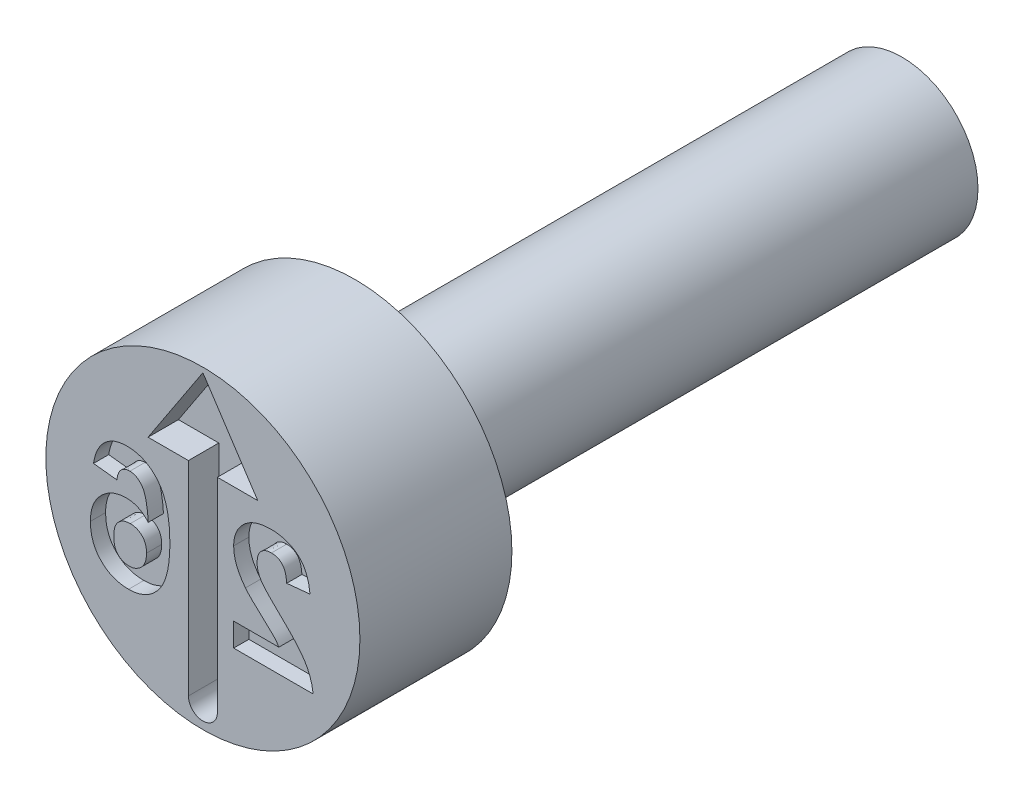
from build123d import *

# Parameters (mm, degrees)
CUT_EXTRUDE4_DEPTH = 0.6
CUT_EXTRUDE5_DEPTH = 0.3


with BuildPart() as part:
    # Sketch2 → Revolve1 (revolve)
    with BuildSketch(Plane(origin=(0, 0, 0), x_dir=(0, 0, -1), z_dir=(1, 0, 0)), mode=Mode.PRIVATE) as revolve1_sk:
        Polygon((0, 3.1), (0, 0), (13.8, 0), (13.8, 1.5), (3, 1.5), (3, 3.1), align=None)
    revolve(revolve1_sk.sketch.rotate(Axis((0, 0, -0.403888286), (0, 0, -1)), 90), axis=Axis((0, 0, -0.403888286), (0, 0, -1)))

    # Sketch3 → Cut-Extrude4 (cut)
    with BuildSketch(Plane.XY):
        with BuildLine():
            Line((0.285709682, 1.359527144), (0.285709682, -2.664242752))
            ThreePointArc((0.285709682, -2.664242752), (0, -2.949952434), (-0.285709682, -2.664242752))
            Line((-0.285709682, -2.664242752), (-0.285709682, 1.359527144))
            Line((-0.285709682, 1.359527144), (-1.082876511, 1.359527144))
            Line((-1.082876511, 1.359527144), (0, 3.00317302))
            Line((0, 3.00317302), (1.082876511, 1.359527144))
            Line((1.082876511, 1.359527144), (0.285709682, 1.359527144))
        make_face()
    extrude(amount=-CUT_EXTRUDE4_DEPTH, mode=Mode.SUBTRACT)

    # Sketch4 → Cut-Extrude5 (cut)
    # profile 1 of 2: a face of its own
    with BuildSketch(Plane.XY):
        with BuildLine():
            Line((0.607692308, -0.938461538), (0.607692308, -1.4))
            Line((0.607692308, -1.4), (2.176923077, -1.4))
            add(Edge.make_bspline(
                [(2.176923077, -1.4), (2.171610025, -1.360554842), (2.160986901, -1.281686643), (2.128143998, -1.166480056), (2.084309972, -1.054058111), (2.036736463, -0.962573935), (1.989419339, -0.888932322), (1.946488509, -0.828589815), (1.895273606, -0.764387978), (1.836517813, -0.695808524), (1.770545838, -0.622637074), (1.696865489, -0.545145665), (1.615125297, -0.46370527), (1.557619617, -0.408403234), (1.527884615, -0.379807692)],
                knots=[0, 0, 0, 0, 1.156289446, 2.311930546, 3.473459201, 4.661751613, 5.303057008, 6.018253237, 6.81459331, 7.690699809, 8.644447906, 9.679642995, 10.800191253, 12, 12, 12, 12], degree=3))
            add(Edge.make_bspline(
                [(1.527884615, -0.379807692), (1.504155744, -0.356902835), (1.458982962, -0.313298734), (1.394656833, -0.250859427), (1.338107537, -0.193459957), (1.288152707, -0.142587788), (1.24594637, -0.096947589), (1.21093334, -0.057256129), (1.182670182, -0.023351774), (1.16736283, -0.00184283), (1.160576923, 0.007692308)],
                knots=[0, 0, 0, 0, 1.480720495, 2.818855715, 4.024636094, 5.098235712, 6.019786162, 6.815086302, 7.474715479, 8, 8, 8, 8], degree=3))
            add(Edge.make_bspline(
                [(1.160576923, 0.007692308), (1.146681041, 0.030774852), (1.119877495, 0.075298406), (1.090485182, 0.1453125), (1.072842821, 0.215312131), (1.070421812, 0.262085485), (1.069230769, 0.285096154)],
                knots=[0, 0, 0, 0, 1.0911822, 2.104764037, 3.067617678, 4, 4, 4, 4], degree=3))
            add(Edge.make_bspline(
                [(1.069230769, 0.285096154), (1.070095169, 0.309041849), (1.071730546, 0.354345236), (1.085443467, 0.418276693), (1.109761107, 0.473234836), (1.143242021, 0.519388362), (1.185578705, 0.555549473), (1.23507152, 0.582269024), (1.29244496, 0.597041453), (1.332770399, 0.598984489), (1.353846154, 0.6)],
                knots=[0, 0, 0, 0, 1.193122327, 2.257294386, 3.237245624, 4.168877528, 5.075331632, 5.990371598, 6.949684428, 8, 8, 8, 8], degree=3))
            add(Edge.make_bspline(
                [(1.353846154, 0.6), (1.374779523, 0.599051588), (1.415218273, 0.597219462), (1.47269051, 0.581214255), (1.522968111, 0.553507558), (1.558798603, 0.521933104), (1.5830038, 0.49122924), (1.599496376, 0.464472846), (1.61371169, 0.434069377), (1.626307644, 0.400361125), (1.636257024, 0.362961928), (1.644269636, 0.322156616), (1.650726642, 0.277725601), (1.652780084, 0.246816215), (1.653846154, 0.230769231)],
                knots=[0, 0, 0, 0, 1.402788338, 2.709884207, 3.961032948, 5.225417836, 5.883680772, 6.578928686, 7.329201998, 8.132101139, 8.990263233, 9.922304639, 10.921339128, 12, 12, 12, 12], degree=3))
            Line((1.653846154, 0.230769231), (2.115384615, 0.275961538))
            add(Edge.make_bspline(
                [(2.115384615, 0.275961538), (2.111673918, 0.307121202), (2.104479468, 0.367534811), (2.086525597, 0.454309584), (2.063787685, 0.534363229), (2.035181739, 0.607547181), (2.001890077, 0.674326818), (1.962214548, 0.733700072), (1.917541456, 0.786324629), (1.867832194, 0.832172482), (1.81340278, 0.871389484), (1.756288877, 0.906396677), (1.695374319, 0.935113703), (1.631329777, 0.958780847), (1.564184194, 0.97769544), (1.493627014, 0.990201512), (1.420093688, 0.998998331), (1.369899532, 0.999661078), (1.344230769, 1)],
                knots=[0, 0, 0, 0, 1.270971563, 2.464210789, 3.586263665, 4.638946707, 5.643716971, 6.603612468, 7.52484387, 8.434700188, 9.336036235, 10.239171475, 11.145359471, 12.059630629, 13.003312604, 13.96741569, 14.960557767, 16, 16, 16, 16], degree=3))
            add(Edge.make_bspline(
                [(1.344230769, 1), (1.316325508, 0.999463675), (1.261976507, 0.998419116), (1.182636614, 0.989793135), (1.108102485, 0.974752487), (1.037722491, 0.95482902), (0.972219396, 0.928229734), (0.911047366, 0.896072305), (0.85516914, 0.857136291), (0.803751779, 0.813545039), (0.757788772, 0.765608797), (0.717529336, 0.714476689), (0.683800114, 0.660184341), (0.655496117, 0.603393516), (0.63448059, 0.543190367), (0.619167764, 0.480407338), (0.609014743, 0.414751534), (0.608137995, 0.369910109), (0.607692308, 0.347115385)],
                knots=[0, 0, 0, 0, 1.210756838, 2.35810096, 3.457354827, 4.507168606, 5.527358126, 6.519769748, 7.499700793, 8.476517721, 9.440526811, 10.376769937, 11.295256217, 12.209626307, 13.124630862, 14.055668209, 15.011616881, 16, 16, 16, 16], degree=3))
            add(Edge.make_bspline(
                [(0.607692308, 0.347115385), (0.608279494, 0.320954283), (0.609444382, 0.269054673), (0.620597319, 0.192331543), (0.637636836, 0.117377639), (0.6628199, 0.04400978), (0.694741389, -0.029531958), (0.735888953, -0.103412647), (0.783664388, -0.179860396), (0.82107067, -0.229287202), (0.840384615, -0.254807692)],
                knots=[0, 0, 0, 0, 0.953409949, 1.89141903, 2.821310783, 3.752688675, 4.715703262, 5.740811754, 6.833515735, 8, 8, 8, 8], degree=3))
            add(Edge.make_bspline(
                [(0.840384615, -0.254807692), (0.847684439, -0.264001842), (0.863318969, -0.283693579), (0.889917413, -0.313887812), (0.920742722, -0.346869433), (0.955359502, -0.383255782), (0.994911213, -0.421758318), (1.037974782, -0.463987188), (1.086445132, -0.507782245), (1.136648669, -0.554235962), (1.187070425, -0.599448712), (1.233415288, -0.6423908), (1.275511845, -0.680385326), (1.31139958, -0.71552976), (1.3431894, -0.745425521), (1.369735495, -0.771605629), (1.391534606, -0.793436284), (1.421572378, -0.827464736), (1.459792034, -0.873488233), (1.486681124, -0.917464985), (1.499519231, -0.938461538)],
                knots=[0, 0, 0, 0, 0.665555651, 1.425465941, 2.280616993, 3.225313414, 4.272635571, 5.410053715, 6.644756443, 7.976022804, 9.288331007, 10.484517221, 11.558462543, 12.503158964, 13.33222979, 14.032602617, 14.617328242, 15.080653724, 16.606167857, 18, 18, 18, 18], degree=3))
            Line((1.499519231, -0.938461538), (0.607692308, -0.938461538))
        make_face()
    # profile 2 of 2: a face of its own
    with BuildSketch(Plane.XY):
        with BuildLine():
            Line((-2.159076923, 0.373557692), (-1.697538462, 0.323076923))
            add(Edge.make_bspline(
                [(-1.697538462, 0.323076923), (-1.694446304, 0.345306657), (-1.688627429, 0.387138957), (-1.671392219, 0.444867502), (-1.647398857, 0.493431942), (-1.616601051, 0.53290018), (-1.57991762, 0.563276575), (-1.53811883, 0.584860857), (-1.491231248, 0.597673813), (-1.458357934, 0.599204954), (-1.441288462, 0.6)],
                knots=[0, 0, 0, 0, 1.280716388, 2.410074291, 3.425374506, 4.35753932, 5.248331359, 6.12451615, 7.026154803, 8, 8, 8, 8], degree=3))
            add(Edge.make_bspline(
                [(-1.441288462, 0.6), (-1.429713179, 0.599716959), (-1.406678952, 0.599153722), (-1.373126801, 0.592002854), (-1.340778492, 0.581390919), (-1.309898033, 0.566361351), (-1.280331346, 0.546968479), (-1.252527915, 0.522980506), (-1.225209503, 0.495661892), (-1.199984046, 0.462673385), (-1.175783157, 0.423612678), (-1.154945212, 0.375795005), (-1.136372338, 0.319264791), (-1.120469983, 0.253745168), (-1.106038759, 0.17965201), (-1.094209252, 0.096685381), (-1.084743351, 0.004770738), (-1.080202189, -0.059599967), (-1.077826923, -0.093269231)],
                knots=[0, 0, 0, 0, 0.642458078, 1.278459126, 1.898279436, 2.531842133, 3.181731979, 3.858193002, 4.57010051, 5.325711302, 6.161524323, 7.118599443, 8.217371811, 9.466325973, 10.864147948, 12.412648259, 14.123626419, 16, 16, 16, 16], degree=3))
            add(Edge.make_bspline(
                [(-1.077826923, -0.093269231), (-1.092577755, -0.077247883), (-1.121502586, -0.045831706), (-1.169498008, -0.00487223), (-1.219780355, 0.030145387), (-1.272896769, 0.058874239), (-1.329137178, 0.08025342), (-1.387482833, 0.096486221), (-1.448697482, 0.105579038), (-1.490298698, 0.106979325), (-1.511480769, 0.107692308)],
                knots=[0, 0, 0, 0, 1.057745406, 2.074127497, 3.059409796, 4.031705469, 5.000875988, 5.977809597, 6.970362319, 8, 8, 8, 8], degree=3))
            add(Edge.make_bspline(
                [(-1.511480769, 0.107692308), (-1.535386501, 0.107003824), (-1.582591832, 0.105644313), (-1.652136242, 0.096108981), (-1.718868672, 0.078962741), (-1.783091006, 0.055768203), (-1.845120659, 0.026560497), (-1.903771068, -0.010412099), (-1.959962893, -0.053520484), (-2.012923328, -0.102771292), (-2.061581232, -0.156992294), (-2.104541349, -0.215555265), (-2.139896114, -0.278639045), (-2.170120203, -0.344831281), (-2.192608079, -0.415438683), (-2.208931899, -0.489445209), (-2.21867607, -0.567530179), (-2.219958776, -0.620805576), (-2.220615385, -0.648076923)],
                knots=[0, 0, 0, 0, 0.99135015, 1.957564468, 2.903754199, 3.843479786, 4.78583385, 5.741106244, 6.712813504, 7.719198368, 8.735844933, 9.730198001, 10.724351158, 11.729813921, 12.742848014, 13.790983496, 14.86921809, 16, 16, 16, 16], degree=3))
            add(Edge.make_bspline(
                [(-2.220615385, -0.648076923), (-2.219949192, -0.676947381), (-2.218649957, -0.733251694), (-2.209086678, -0.815710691), (-2.192193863, -0.8935427), (-2.169114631, -0.967372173), (-2.139262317, -1.036614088), (-2.103098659, -1.101839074), (-2.059399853, -1.161932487), (-2.010149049, -1.217702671), (-1.95524415, -1.26747034), (-1.896731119, -1.311540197), (-1.833960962, -1.348174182), (-1.7678615, -1.379007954), (-1.697297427, -1.401635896), (-1.623512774, -1.418605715), (-1.545907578, -1.428955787), (-1.492922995, -1.430155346), (-1.465807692, -1.430769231)],
                knots=[0, 0, 0, 0, 1.13287417, 2.209376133, 3.25169942, 4.254157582, 5.240146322, 6.205890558, 7.174579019, 8.150183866, 9.1206468, 10.07783463, 11.019441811, 11.967766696, 12.934309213, 13.921380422, 14.936249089, 16, 16, 16, 16], degree=3))
            add(Edge.make_bspline(
                [(-1.465807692, -1.430769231), (-1.436754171, -1.429956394), (-1.379629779, -1.428358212), (-1.296006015, -1.415205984), (-1.21650366, -1.392954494), (-1.141132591, -1.36187934), (-1.069266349, -1.322791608), (-1.001572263, -1.274237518), (-0.938229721, -1.216680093), (-0.878400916, -1.150898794), (-0.823958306, -1.074916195), (-0.777594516, -0.987096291), (-0.738273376, -0.888400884), (-0.706260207, -0.778576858), (-0.681548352, -0.657632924), (-0.664304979, -0.52555894), (-0.652851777, -0.382573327), (-0.651885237, -0.283517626), (-0.651384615, -0.232211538)],
                knots=[0, 0, 0, 0, 0.852151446, 1.675481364, 2.476404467, 3.269281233, 4.062617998, 4.871616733, 5.707301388, 6.56955125, 7.476395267, 8.442009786, 9.475854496, 10.58877921, 11.794095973, 13.094195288, 14.494932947, 16, 16, 16, 16], degree=3))
            add(Edge.make_bspline(
                [(-0.651384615, -0.232211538), (-0.652102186, -0.179626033), (-0.653488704, -0.078018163), (-0.664645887, 0.068689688), (-0.682368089, 0.204168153), (-0.708184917, 0.32811172), (-0.741206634, 0.440777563), (-0.781240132, 0.542392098), (-0.829291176, 0.632587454), (-0.885158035, 0.711070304), (-0.946627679, 0.779292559), (-1.012677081, 0.838179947), (-1.083054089, 0.88830189), (-1.157757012, 0.929531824), (-1.237399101, 0.960788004), (-1.321224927, 0.983358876), (-1.409375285, 0.997864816), (-1.469756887, 0.99928084), (-1.500423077, 1)],
                knots=[0, 0, 0, 0, 1.491699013, 2.882321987, 4.171520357, 5.365488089, 6.470299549, 7.49861535, 8.458736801, 9.361983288, 10.224742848, 11.058789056, 11.867429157, 12.671146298, 13.473202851, 14.288259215, 15.130652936, 16, 16, 16, 16], degree=3))
            add(Edge.make_bspline(
                [(-1.500423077, 1), (-1.522083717, 0.999610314), (-1.564427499, 0.998848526), (-1.626488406, 0.990758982), (-1.685693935, 0.978388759), (-1.742199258, 0.961265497), (-1.795606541, 0.938334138), (-1.846127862, 0.910398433), (-1.893933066, 0.877534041), (-1.938773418, 0.839952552), (-1.980288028, 0.797540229), (-2.017774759, 0.750201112), (-2.051481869, 0.698506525), (-2.081556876, 0.64249937), (-2.106783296, 0.581643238), (-2.128469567, 0.516416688), (-2.146305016, 0.446679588), (-2.154754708, 0.398303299), (-2.159076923, 0.373557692)],
                knots=[0, 0, 0, 0, 1.036027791, 2.025301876, 2.989435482, 3.928225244, 4.845595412, 5.765526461, 6.686607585, 7.61747015, 8.561102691, 9.521661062, 10.50224679, 11.510949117, 12.559251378, 13.650572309, 14.798212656, 16, 16, 16, 16], degree=3))
        make_face()
        with BuildLine():
            add(Edge.make_bspline(
                [(-1.112923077, -0.6375), (-1.113098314, -0.652742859), (-1.113440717, -0.682526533), (-1.119055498, -0.725744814), (-1.127126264, -0.766261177), (-1.137997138, -0.804300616), (-1.153064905, -0.839287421), (-1.170941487, -0.871923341), (-1.192087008, -0.901912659), (-1.224532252, -0.937098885), (-1.269365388, -0.974055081), (-1.328202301, -1.006964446), (-1.391244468, -1.027421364), (-1.43472886, -1.029646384), (-1.456673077, -1.030769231)],
                knots=[0, 0, 0, 0, 0.93816693, 1.833124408, 2.679057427, 3.481731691, 4.264557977, 5.020023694, 5.770442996, 6.518065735, 7.962605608, 9.32780964, 10.651490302, 12, 12, 12, 12], degree=3))
            add(Edge.make_bspline(
                [(-1.456673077, -1.030769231), (-1.477460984, -1.029836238), (-1.517922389, -1.028020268), (-1.575702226, -1.011423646), (-1.628186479, -0.985249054), (-1.666661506, -0.954519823), (-1.693489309, -0.924631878), (-1.711516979, -0.898420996), (-1.726191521, -0.868520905), (-1.738188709, -0.835424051), (-1.747852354, -0.799258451), (-1.754450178, -0.759660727), (-1.75819255, -0.716739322), (-1.758775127, -0.687026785), (-1.759076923, -0.671634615)],
                knots=[0, 0, 0, 0, 1.399678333, 2.724321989, 4.020062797, 5.33532049, 6.016755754, 6.724441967, 7.473839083, 8.257094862, 9.096253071, 9.995581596, 10.961638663, 12, 12, 12, 12], degree=3))
            add(Edge.make_bspline(
                [(-1.759076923, -0.671634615), (-1.758819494, -0.655758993), (-1.758321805, -0.625066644), (-1.753966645, -0.580705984), (-1.746841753, -0.539696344), (-1.7368806, -0.501747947), (-1.723397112, -0.46736839), (-1.707489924, -0.43586424), (-1.688177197, -0.408089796), (-1.65947529, -0.375423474), (-1.617741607, -0.342507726), (-1.561977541, -0.312526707), (-1.499471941, -0.295530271), (-1.455970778, -0.293402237), (-1.433596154, -0.292307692)],
                knots=[0, 0, 0, 0, 1.008384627, 1.949510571, 2.828269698, 3.650667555, 4.437180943, 5.170285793, 5.887596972, 6.580056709, 7.926803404, 9.238379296, 10.579573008, 12, 12, 12, 12], degree=3))
            add(Edge.make_bspline(
                [(-1.433596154, -0.292307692), (-1.41184234, -0.293193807), (-1.369593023, -0.294914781), (-1.308875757, -0.312197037), (-1.25331883, -0.339696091), (-1.2123978, -0.372001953), (-1.183555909, -0.402449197), (-1.164665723, -0.428372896), (-1.148222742, -0.456597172), (-1.135237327, -0.487851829), (-1.125225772, -0.521550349), (-1.118045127, -0.557923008), (-1.113699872, -0.596849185), (-1.113186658, -0.623706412), (-1.112923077, -0.6375)],
                knots=[0, 0, 0, 0, 1.469034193, 2.853094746, 4.235454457, 5.641396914, 6.354997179, 7.06867986, 7.807229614, 8.560602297, 9.353235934, 10.182779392, 11.06669468, 12, 12, 12, 12], degree=3))
        make_face(mode=Mode.SUBTRACT)
    extrude(amount=-CUT_EXTRUDE5_DEPTH, mode=Mode.SUBTRACT)


solid = part.part
